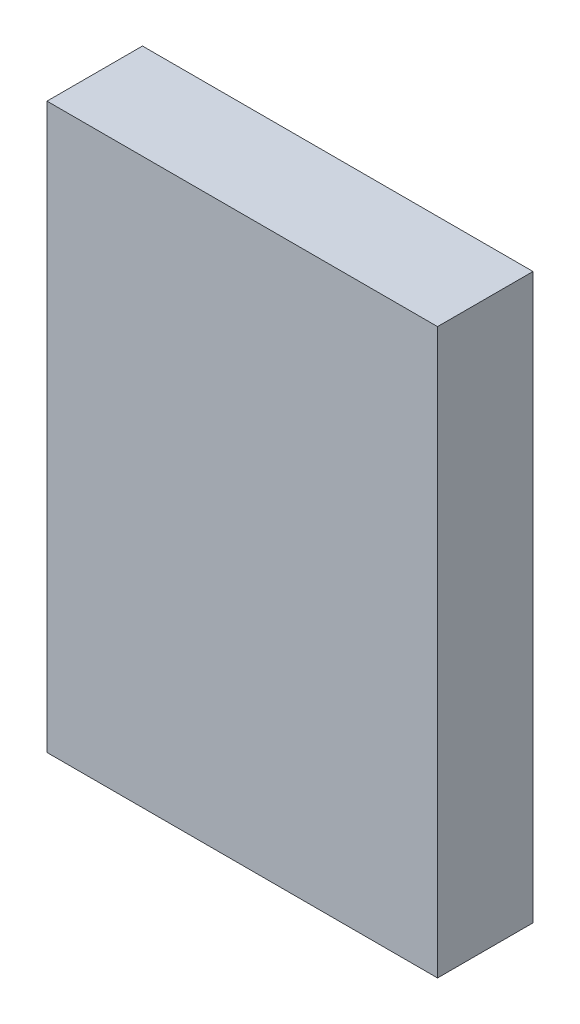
ISO-10303-21;
HEADER;
FILE_DESCRIPTION(('STEP AP214'),'2;1');
FILE_NAME('part.step','',(''),(''),'','','');
FILE_SCHEMA(('AUTOMOTIVE_DESIGN { 1 0 10303 214 1 1 1 1 }'));
ENDSEC;
DATA;
#1=APPLICATION_CONTEXT('core data for automotive mechanical design processes');
#2=APPLICATION_PROTOCOL_DEFINITION('international standard','automotive_design',2000,#1);
#3=PRODUCT_CONTEXT('',#1,'mechanical');
#4=PRODUCT('Part','Part','',(#3));
#5=PRODUCT_RELATED_PRODUCT_CATEGORY('part','',(#4));
#6=PRODUCT_DEFINITION_FORMATION('','',#4);
#7=PRODUCT_DEFINITION_CONTEXT('part definition',#1,'design');
#8=PRODUCT_DEFINITION('design','',#6,#7);
#9=PRODUCT_DEFINITION_SHAPE('','',#8);
#10=(LENGTH_UNIT() NAMED_UNIT(*) SI_UNIT(.MILLI.,.METRE.));
#11=(NAMED_UNIT(*) PLANE_ANGLE_UNIT() SI_UNIT($,.RADIAN.));
#12=(NAMED_UNIT(*) SI_UNIT($,.STERADIAN.) SOLID_ANGLE_UNIT());
#13=UNCERTAINTY_MEASURE_WITH_UNIT(LENGTH_MEASURE(1.E-05),#10,'distance_accuracy_value','');
#14=(GEOMETRIC_REPRESENTATION_CONTEXT(3) GLOBAL_UNCERTAINTY_ASSIGNED_CONTEXT((#13)) GLOBAL_UNIT_ASSIGNED_CONTEXT((#10,
#11,#12)) REPRESENTATION_CONTEXT('',''));
#15=CARTESIAN_POINT('',(0.,0.,0.));
#16=DIRECTION('',(0.,0.,1.));
#17=DIRECTION('',(1.,0.,0.));
#18=AXIS2_PLACEMENT_3D('',#15,#16,#17);
#19=CARTESIAN_POINT('',(1.143,-1.651,0.5588));
#20=DIRECTION('',(0.,0.,1.));
#21=DIRECTION('',(1.,0.,0.));
#22=AXIS2_PLACEMENT_3D('',#19,#20,#21);
#23=PLANE('',#22);
#24=DIRECTION('',(0.,1.,0.));
#25=VECTOR('',#24,1.);
#26=CARTESIAN_POINT('',(-1.143,-1.651,0.5588));
#27=LINE('',#26,#25);
#28=CARTESIAN_POINT('',(-1.143,-1.651,0.5588));
#29=VERTEX_POINT('',#28);
#30=CARTESIAN_POINT('',(-1.143,1.651,0.5588));
#31=VERTEX_POINT('',#30);
#32=EDGE_CURVE('E53',#29,#31,#27,.T.);
#33=ORIENTED_EDGE('',*,*,#32,.F.);
#34=DIRECTION('',(1.,0.,0.));
#35=VECTOR('',#34,1.);
#36=CARTESIAN_POINT('',(1.143,-1.651,0.5588));
#37=LINE('',#36,#35);
#38=CARTESIAN_POINT('',(1.143,-1.651,0.5588));
#39=VERTEX_POINT('',#38);
#40=EDGE_CURVE('E68',#39,#29,#37,.F.);
#41=ORIENTED_EDGE('',*,*,#40,.F.);
#42=DIRECTION('',(0.,1.,0.));
#43=VECTOR('',#42,1.);
#44=CARTESIAN_POINT('',(1.143,1.651,0.5588));
#45=LINE('',#44,#43);
#46=CARTESIAN_POINT('',(1.143,1.651,0.5588));
#47=VERTEX_POINT('',#46);
#48=EDGE_CURVE('E20',#47,#39,#45,.F.);
#49=ORIENTED_EDGE('',*,*,#48,.F.);
#50=DIRECTION('',(1.,0.,0.));
#51=VECTOR('',#50,1.);
#52=CARTESIAN_POINT('',(-1.143,1.651,0.5588));
#53=LINE('',#52,#51);
#54=EDGE_CURVE('E58',#31,#47,#53,.T.);
#55=ORIENTED_EDGE('',*,*,#54,.F.);
#56=EDGE_LOOP('',(#33,#41,#49,#55));
#57=FACE_BOUND('',#56,.T.);
#58=ADVANCED_FACE('F17',(#57),#23,.T.);
#59=CARTESIAN_POINT('',(1.143,1.651,0.));
#60=DIRECTION('',(1.,0.,0.));
#61=DIRECTION('',(0.,0.,-1.));
#62=AXIS2_PLACEMENT_3D('',#59,#60,#61);
#63=PLANE('',#62);
#64=DIRECTION('',(0.,0.,-1.));
#65=VECTOR('',#64,1.);
#66=CARTESIAN_POINT('',(1.143,-1.651,0.));
#67=LINE('',#66,#65);
#68=CARTESIAN_POINT('',(1.143,-1.651,0.));
#69=VERTEX_POINT('',#68);
#70=EDGE_CURVE('E79',#69,#39,#67,.F.);
#71=ORIENTED_EDGE('',*,*,#70,.F.);
#72=DIRECTION('',(0.,1.,0.));
#73=VECTOR('',#72,1.);
#74=CARTESIAN_POINT('',(1.143,-1.651,0.));
#75=LINE('',#74,#73);
#76=CARTESIAN_POINT('',(1.143,1.651,0.));
#77=VERTEX_POINT('',#76);
#78=EDGE_CURVE('E74',#69,#77,#75,.T.);
#79=ORIENTED_EDGE('',*,*,#78,.T.);
#80=DIRECTION('',(0.,0.,1.));
#81=VECTOR('',#80,1.);
#82=CARTESIAN_POINT('',(1.143,1.651,0.));
#83=LINE('',#82,#81);
#84=EDGE_CURVE('E63',#47,#77,#83,.F.);
#85=ORIENTED_EDGE('',*,*,#84,.F.);
#86=ORIENTED_EDGE('',*,*,#48,.T.);
#87=EDGE_LOOP('',(#71,#79,#85,#86));
#88=FACE_BOUND('',#87,.T.);
#89=ADVANCED_FACE('F73',(#88),#63,.T.);
#90=CARTESIAN_POINT('',(-1.143,1.651,0.));
#91=DIRECTION('',(0.,1.,0.));
#92=DIRECTION('',(0.,0.,1.));
#93=AXIS2_PLACEMENT_3D('',#90,#91,#92);
#94=PLANE('',#93);
#95=ORIENTED_EDGE('',*,*,#84,.T.);
#96=DIRECTION('',(1.,0.,0.));
#97=VECTOR('',#96,1.);
#98=CARTESIAN_POINT('',(1.143,1.651,0.));
#99=LINE('',#98,#97);
#100=CARTESIAN_POINT('',(-1.143,1.651,0.));
#101=VERTEX_POINT('',#100);
#102=EDGE_CURVE('E84',#77,#101,#99,.F.);
#103=ORIENTED_EDGE('',*,*,#102,.T.);
#104=DIRECTION('',(0.,0.,1.));
#105=VECTOR('',#104,1.);
#106=CARTESIAN_POINT('',(-1.143,1.651,0.));
#107=LINE('',#106,#105);
#108=EDGE_CURVE('E65',#31,#101,#107,.F.);
#109=ORIENTED_EDGE('',*,*,#108,.F.);
#110=ORIENTED_EDGE('',*,*,#54,.T.);
#111=EDGE_LOOP('',(#95,#103,#109,#110));
#112=FACE_BOUND('',#111,.T.);
#113=ADVANCED_FACE('F60',(#112),#94,.T.);
#114=CARTESIAN_POINT('',(-1.143,-1.651,0.));
#115=DIRECTION('',(-1.,0.,0.));
#116=DIRECTION('',(0.,0.,1.));
#117=AXIS2_PLACEMENT_3D('',#114,#115,#116);
#118=PLANE('',#117);
#119=ORIENTED_EDGE('',*,*,#108,.T.);
#120=DIRECTION('',(0.,1.,0.));
#121=VECTOR('',#120,1.);
#122=CARTESIAN_POINT('',(-1.143,-1.651,0.));
#123=LINE('',#122,#121);
#124=CARTESIAN_POINT('',(-1.143,-1.651,0.));
#125=VERTEX_POINT('',#124);
#126=EDGE_CURVE('E26',#101,#125,#123,.F.);
#127=ORIENTED_EDGE('',*,*,#126,.T.);
#128=DIRECTION('',(0.,0.,-1.));
#129=VECTOR('',#128,1.);
#130=CARTESIAN_POINT('',(-1.143,-1.651,0.));
#131=LINE('',#130,#129);
#132=EDGE_CURVE('E34',#29,#125,#131,.T.);
#133=ORIENTED_EDGE('',*,*,#132,.F.);
#134=ORIENTED_EDGE('',*,*,#32,.T.);
#135=EDGE_LOOP('',(#119,#127,#133,#134));
#136=FACE_BOUND('',#135,.T.);
#137=ADVANCED_FACE('F88',(#136),#118,.T.);
#138=CARTESIAN_POINT('',(1.143,-1.651,0.));
#139=DIRECTION('',(0.,-1.,0.));
#140=DIRECTION('',(0.,0.,-1.));
#141=AXIS2_PLACEMENT_3D('',#138,#139,#140);
#142=PLANE('',#141);
#143=ORIENTED_EDGE('',*,*,#132,.T.);
#144=DIRECTION('',(1.,0.,0.));
#145=VECTOR('',#144,1.);
#146=CARTESIAN_POINT('',(1.143,-1.651,0.));
#147=LINE('',#146,#145);
#148=EDGE_CURVE('E11',#125,#69,#147,.T.);
#149=ORIENTED_EDGE('',*,*,#148,.T.);
#150=ORIENTED_EDGE('',*,*,#70,.T.);
#151=ORIENTED_EDGE('',*,*,#40,.T.);
#152=EDGE_LOOP('',(#143,#149,#150,#151));
#153=FACE_BOUND('',#152,.T.);
#154=ADVANCED_FACE('F91',(#153),#142,.T.);
#155=CARTESIAN_POINT('',(1.143,-1.651,0.));
#156=DIRECTION('',(0.,0.,1.));
#157=DIRECTION('',(1.,0.,0.));
#158=AXIS2_PLACEMENT_3D('',#155,#156,#157);
#159=PLANE('',#158);
#160=ORIENTED_EDGE('',*,*,#126,.F.);
#161=ORIENTED_EDGE('',*,*,#102,.F.);
#162=ORIENTED_EDGE('',*,*,#78,.F.);
#163=ORIENTED_EDGE('',*,*,#148,.F.);
#164=EDGE_LOOP('',(#160,#161,#162,#163));
#165=FACE_BOUND('',#164,.T.);
#166=ADVANCED_FACE('F90',(#165),#159,.F.);
#167=CLOSED_SHELL('',(#58,#89,#113,#137,#154,#166));
#168=MANIFOLD_SOLID_BREP('B1',#167);
#169=ADVANCED_BREP_SHAPE_REPRESENTATION('',(#18,#168),#14);
#170=SHAPE_DEFINITION_REPRESENTATION(#9,#169);
ENDSEC;
END-ISO-10303-21;
